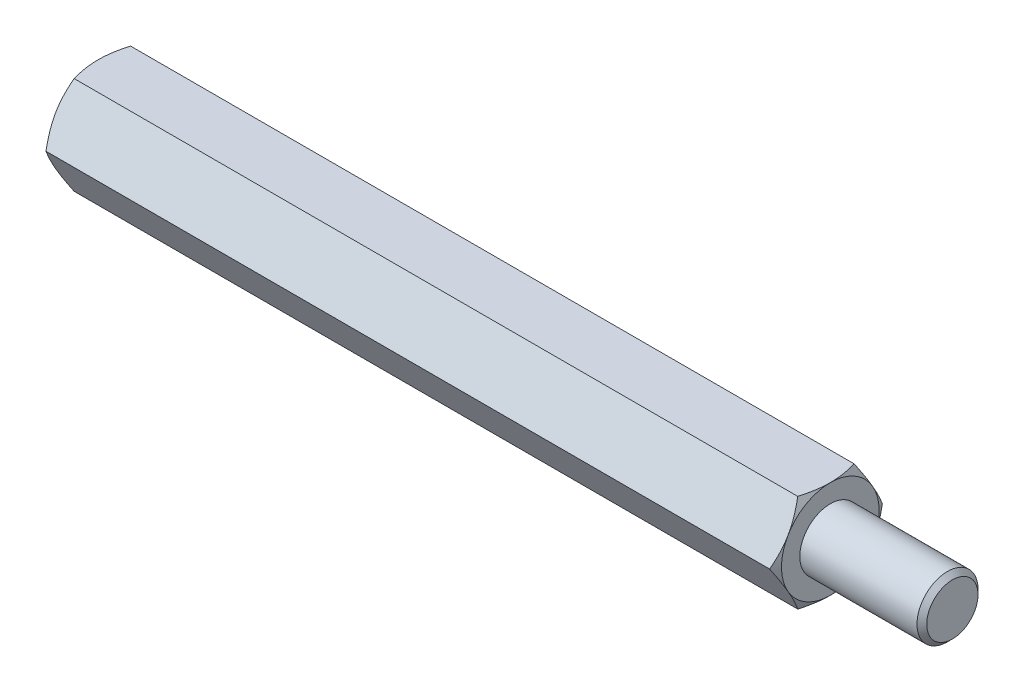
from build123d import *

# Parameters (mm, degrees)
EXTRUDE2_DEPTH = 30
SKETCH3_R      = 2.1
EXTRUDE3_DEPTH = 10
SKETCH5_R      = 2.5
EXTRUDE4_DEPTH = 10
CHAMFER1_SIZE  = 0.4


with BuildPart() as part:
    # Sketch1 → Extrude2 (new, symmetric)
    with BuildSketch(Plane(origin=(0, 0, 0), x_dir=(0, 0, -1), z_dir=(1, 0, 0))):
        Polygon((2.309401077, 4), (-2.309401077, 4), (-4.618802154, 0), (-2.309401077, -4), (2.309401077, -4), (4.618802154, 0), align=None)
    extrude(amount=EXTRUDE2_DEPTH, both=True)

    # Sketch2 → Cut-Revolve1 (revolve, cut)
    with BuildSketch(Plane.XY):
        with BuildLine():
            Line((-30, 4), (-28.5, 6.598076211))
            ThreePointArc((-28.5, 6.598076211), (-28.98810136, 7.776457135), (-30, 7))
            Line((-30, 7), (-30, 4))
        make_face()
    cut_revolve1 = revolve(axis=Axis((0, 0, 0), (1, 0, 0)), mode=Mode.SUBTRACT)

    # Mirror1: Cut-Revolve1 across plane
    add(cut_revolve1.mirror(Plane(origin=(0, 0, 0), x_dir=(0, 0, 1), z_dir=(1, 0, 0))), mode=Mode.SUBTRACT)

    # Sketch3 → Extrude3 (cut)
    with BuildSketch(Plane.ZY.offset(30)):
        Circle(SKETCH3_R)
    extrude(amount=-EXTRUDE3_DEPTH, mode=Mode.SUBTRACT)

    # Sketch4 → Cut-Revolve2 (revolve, cut)
    with BuildSketch(Plane.XY, mode=Mode.PRIVATE) as cut_revolve2_sk:
        Polygon((-20, 0), (-20, 2.1), (-18.787564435, 0), align=None)
    revolve(cut_revolve2_sk.sketch.rotate(Axis((-18.787564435, 0, 0), (-1, 0, 0)), 270), axis=Axis((-18.787564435, 0, 0), (-1, 0, 0)), mode=Mode.SUBTRACT)

    # Sketch5 → Extrude4 (add)
    with BuildSketch(Plane(origin=(30, 0, 0), x_dir=(0, 0, -1), z_dir=(1, 0, 0))):
        Circle(SKETCH5_R)
    extrude(amount=EXTRUDE4_DEPTH)

    # Chamfer1
    chamfer1_edges = [part.edges().sort_by_distance(p)[0] for p in [
        (40, 0, 2.5),
    ]]
    chamfer(chamfer1_edges, length=CHAMFER1_SIZE)


solid = part.part
